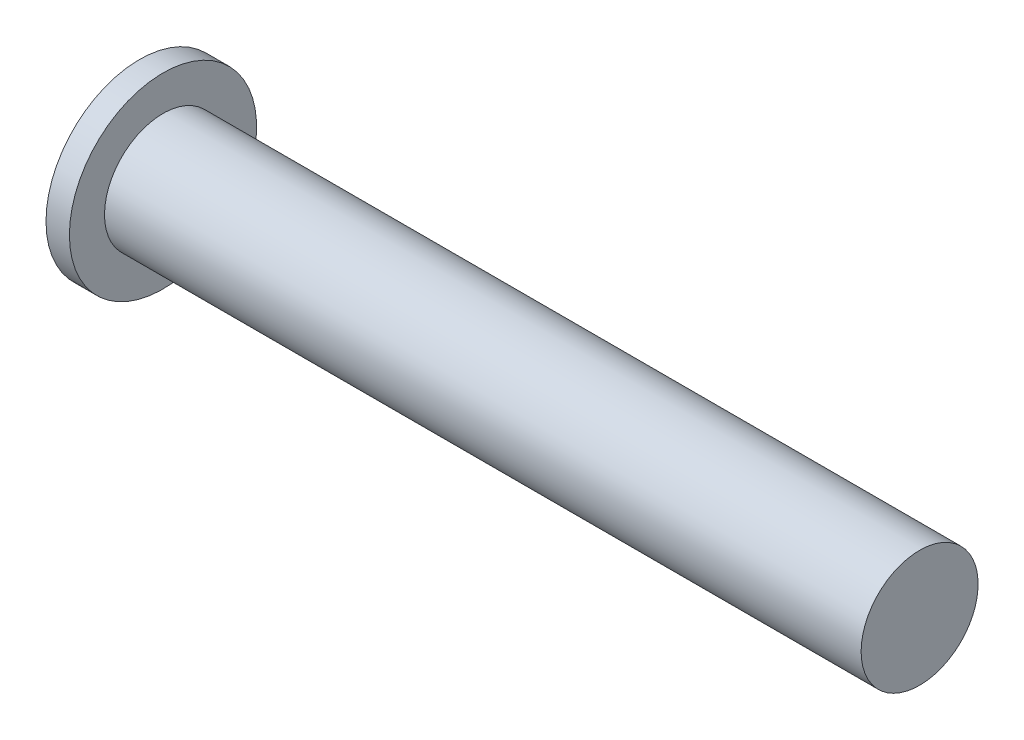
ISO-10303-21;
HEADER;
FILE_DESCRIPTION(('STEP AP214'),'2;1');
FILE_NAME('part.step','',(''),(''),'','','');
FILE_SCHEMA(('AUTOMOTIVE_DESIGN { 1 0 10303 214 1 1 1 1 }'));
ENDSEC;
DATA;
#1=APPLICATION_CONTEXT('core data for automotive mechanical design processes');
#2=APPLICATION_PROTOCOL_DEFINITION('international standard','automotive_design',2000,#1);
#3=PRODUCT_CONTEXT('',#1,'mechanical');
#4=PRODUCT('Part','Part','',(#3));
#5=PRODUCT_RELATED_PRODUCT_CATEGORY('part','',(#4));
#6=PRODUCT_DEFINITION_FORMATION('','',#4);
#7=PRODUCT_DEFINITION_CONTEXT('part definition',#1,'design');
#8=PRODUCT_DEFINITION('design','',#6,#7);
#9=PRODUCT_DEFINITION_SHAPE('','',#8);
#10=(LENGTH_UNIT() NAMED_UNIT(*) SI_UNIT(.MILLI.,.METRE.));
#11=(NAMED_UNIT(*) PLANE_ANGLE_UNIT() SI_UNIT($,.RADIAN.));
#12=(NAMED_UNIT(*) SI_UNIT($,.STERADIAN.) SOLID_ANGLE_UNIT());
#13=UNCERTAINTY_MEASURE_WITH_UNIT(LENGTH_MEASURE(1.E-05),#10,'distance_accuracy_value','');
#14=(GEOMETRIC_REPRESENTATION_CONTEXT(3) GLOBAL_UNCERTAINTY_ASSIGNED_CONTEXT((#13)) GLOBAL_UNIT_ASSIGNED_CONTEXT((#10,
#11,#12)) REPRESENTATION_CONTEXT('',''));
#15=CARTESIAN_POINT('',(0.,0.,0.));
#16=DIRECTION('',(0.,0.,1.));
#17=DIRECTION('',(1.,0.,0.));
#18=AXIS2_PLACEMENT_3D('',#15,#16,#17);
#19=CARTESIAN_POINT('',(0.,0.,0.));
#20=DIRECTION('',(1.,0.,0.));
#21=DIRECTION('',(0.,0.,-1.));
#22=AXIS2_PLACEMENT_3D('',#19,#20,#21);
#23=PLANE('',#22);
#24=CARTESIAN_POINT('',(0.,0.,0.));
#25=DIRECTION('',(-1.,0.,0.));
#26=DIRECTION('',(0.,0.,1.));
#27=AXIS2_PLACEMENT_3D('',#24,#25,#26);
#28=CIRCLE('',#27,4.8768);
#29=CARTESIAN_POINT('',(0.,0.,4.8768));
#30=VERTEX_POINT('',#29);
#31=EDGE_CURVE('E10',#30,#30,#28,.T.);
#32=ORIENTED_EDGE('',*,*,#31,.T.);
#33=EDGE_LOOP('',(#32));
#34=FACE_BOUND('',#33,.T.);
#35=ADVANCED_FACE('F31',(#34),#23,.F.);
#36=CARTESIAN_POINT('',(40.64,0.,0.));
#37=DIRECTION('',(-1.,0.,0.));
#38=DIRECTION('',(0.,0.,1.));
#39=AXIS2_PLACEMENT_3D('',#36,#37,#38);
#40=CYLINDRICAL_SURFACE('',#39,4.8768);
#41=ORIENTED_EDGE('',*,*,#31,.F.);
#42=EDGE_LOOP('',(#41));
#43=FACE_BOUND('',#42,.T.);
#44=CARTESIAN_POINT('',(1.2192,0.,0.));
#45=DIRECTION('',(-1.,0.,0.));
#46=DIRECTION('',(0.,0.,1.));
#47=AXIS2_PLACEMENT_3D('',#44,#45,#46);
#48=CIRCLE('',#47,4.8768);
#49=CARTESIAN_POINT('',(1.2192,0.,4.8768));
#50=VERTEX_POINT('',#49);
#51=EDGE_CURVE('E37',#50,#50,#48,.T.);
#52=ORIENTED_EDGE('',*,*,#51,.T.);
#53=EDGE_LOOP('',(#52));
#54=FACE_BOUND('',#53,.T.);
#55=ADVANCED_FACE('F63',(#43,#54),#40,.T.);
#56=CARTESIAN_POINT('',(1.2192,4.8768,0.));
#57=DIRECTION('',(-1.,0.,0.));
#58=DIRECTION('',(0.,0.,1.));
#59=AXIS2_PLACEMENT_3D('',#56,#57,#58);
#60=PLANE('',#59);
#61=ORIENTED_EDGE('',*,*,#51,.F.);
#62=EDGE_LOOP('',(#61));
#63=FACE_BOUND('',#62,.T.);
#64=CARTESIAN_POINT('',(1.2192,0.,0.));
#65=DIRECTION('',(-1.,0.,0.));
#66=DIRECTION('',(0.,0.,1.));
#67=AXIS2_PLACEMENT_3D('',#64,#65,#66);
#68=CIRCLE('',#67,3.048);
#69=CARTESIAN_POINT('',(1.2192,0.,3.048));
#70=VERTEX_POINT('',#69);
#71=EDGE_CURVE('E41',#70,#70,#68,.T.);
#72=ORIENTED_EDGE('',*,*,#71,.T.);
#73=EDGE_LOOP('',(#72));
#74=FACE_BOUND('',#73,.T.);
#75=ADVANCED_FACE('F59',(#63,#74),#60,.F.);
#76=CARTESIAN_POINT('',(40.64,0.,0.));
#77=DIRECTION('',(-1.,0.,0.));
#78=DIRECTION('',(0.,0.,1.));
#79=AXIS2_PLACEMENT_3D('',#76,#77,#78);
#80=CYLINDRICAL_SURFACE('',#79,3.048);
#81=ORIENTED_EDGE('',*,*,#71,.F.);
#82=EDGE_LOOP('',(#81));
#83=FACE_BOUND('',#82,.T.);
#84=CARTESIAN_POINT('',(40.64,0.,0.));
#85=DIRECTION('',(-1.,0.,0.));
#86=DIRECTION('',(0.,0.,1.));
#87=AXIS2_PLACEMENT_3D('',#84,#85,#86);
#88=CIRCLE('',#87,3.048);
#89=CARTESIAN_POINT('',(40.64,0.,3.048));
#90=VERTEX_POINT('',#89);
#91=EDGE_CURVE('E45',#90,#90,#88,.T.);
#92=ORIENTED_EDGE('',*,*,#91,.T.);
#93=EDGE_LOOP('',(#92));
#94=FACE_BOUND('',#93,.T.);
#95=ADVANCED_FACE('F51',(#83,#94),#80,.T.);
#96=CARTESIAN_POINT('',(40.64,3.048,0.));
#97=DIRECTION('',(-1.,0.,0.));
#98=DIRECTION('',(0.,0.,1.));
#99=AXIS2_PLACEMENT_3D('',#96,#97,#98);
#100=PLANE('',#99);
#101=ORIENTED_EDGE('',*,*,#91,.F.);
#102=EDGE_LOOP('',(#101));
#103=FACE_BOUND('',#102,.T.);
#104=ADVANCED_FACE('F53',(#103),#100,.F.);
#105=CLOSED_SHELL('',(#35,#55,#75,#95,#104));
#106=MANIFOLD_SOLID_BREP('B2',#105);
#107=ADVANCED_BREP_SHAPE_REPRESENTATION('',(#18,#106),#14);
#108=SHAPE_DEFINITION_REPRESENTATION(#9,#107);
ENDSEC;
END-ISO-10303-21;
